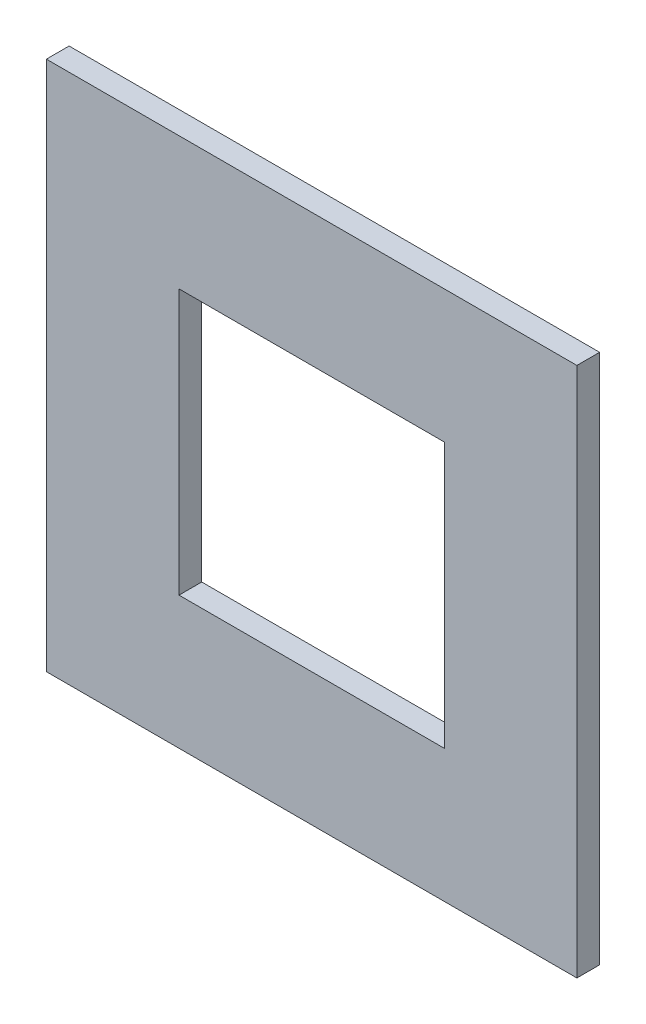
from build123d import *

# Parameters (mm, degrees)
ESQUISSE1_W        = 70
ESQUISSE1_H        = 70
ESQUISSE1_W_2      = 35
ESQUISSE1_H_2      = 35
BOSS_EXTRU_1_DEPTH = 3


with BuildPart() as part:
    # Esquisse1 → Boss.-Extru.1 (new body)
    with BuildSketch(Plane.XY):
        Rectangle(ESQUISSE1_W, ESQUISSE1_H)
        Rectangle(ESQUISSE1_W_2, ESQUISSE1_H_2, mode=Mode.SUBTRACT)
    extrude(amount=BOSS_EXTRU_1_DEPTH)


solid = part.part
